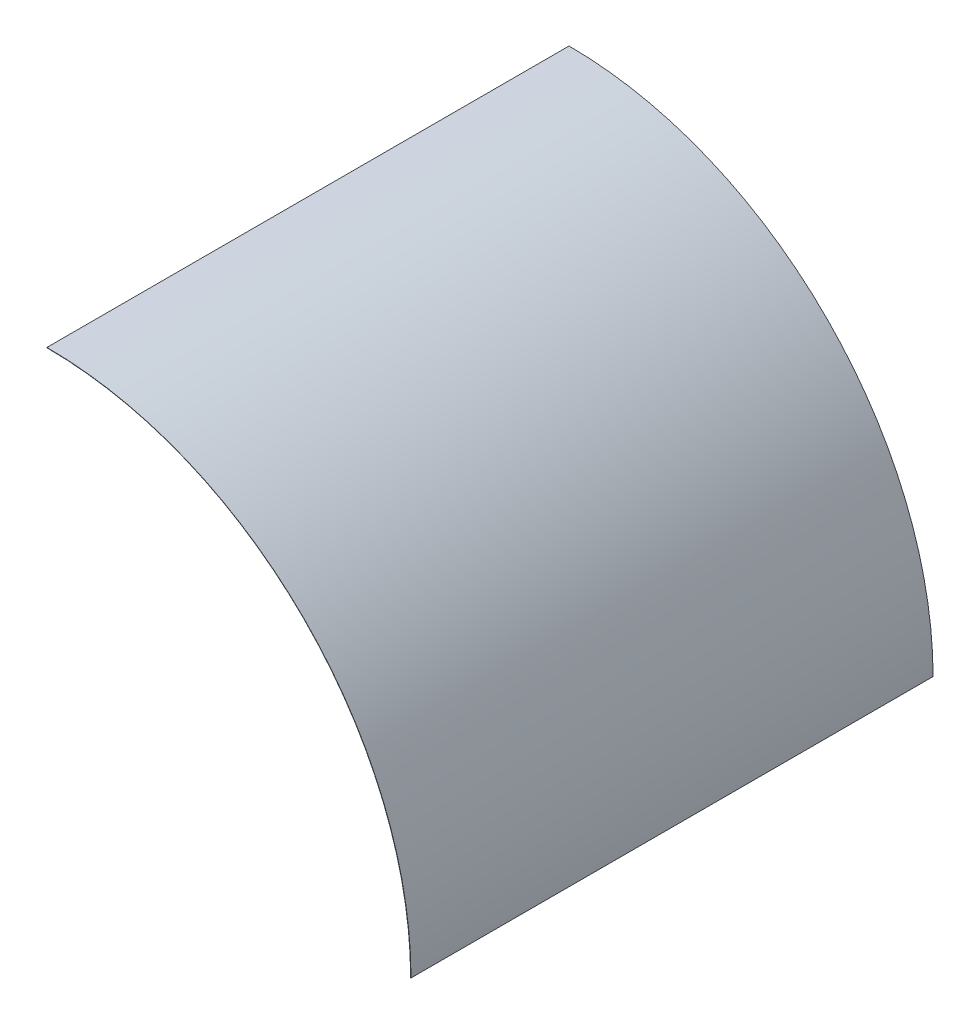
ISO-10303-21;
HEADER;
FILE_DESCRIPTION(('STEP AP214'),'2;1');
FILE_NAME('part.step','',(''),(''),'','','');
FILE_SCHEMA(('AUTOMOTIVE_DESIGN { 1 0 10303 214 1 1 1 1 }'));
ENDSEC;
DATA;
#1=APPLICATION_CONTEXT('core data for automotive mechanical design processes');
#2=APPLICATION_PROTOCOL_DEFINITION('international standard','automotive_design',2000,#1);
#3=PRODUCT_CONTEXT('',#1,'mechanical');
#4=PRODUCT('Part','Part','',(#3));
#5=PRODUCT_RELATED_PRODUCT_CATEGORY('part','',(#4));
#6=PRODUCT_DEFINITION_FORMATION('','',#4);
#7=PRODUCT_DEFINITION_CONTEXT('part definition',#1,'design');
#8=PRODUCT_DEFINITION('design','',#6,#7);
#9=PRODUCT_DEFINITION_SHAPE('','',#8);
#10=(LENGTH_UNIT() NAMED_UNIT(*) SI_UNIT(.MILLI.,.METRE.));
#11=(NAMED_UNIT(*) PLANE_ANGLE_UNIT() SI_UNIT($,.RADIAN.));
#12=(NAMED_UNIT(*) SI_UNIT($,.STERADIAN.) SOLID_ANGLE_UNIT());
#13=UNCERTAINTY_MEASURE_WITH_UNIT(LENGTH_MEASURE(1.E-05),#10,'distance_accuracy_value','');
#14=(GEOMETRIC_REPRESENTATION_CONTEXT(3) GLOBAL_UNCERTAINTY_ASSIGNED_CONTEXT((#13)) GLOBAL_UNIT_ASSIGNED_CONTEXT((#10,
#11,#12)) REPRESENTATION_CONTEXT('',''));
#15=CARTESIAN_POINT('',(0.,0.,0.));
#16=DIRECTION('',(0.,0.,1.));
#17=DIRECTION('',(1.,0.,0.));
#18=AXIS2_PLACEMENT_3D('',#15,#16,#17);
#19=CARTESIAN_POINT('',(0.,0.,-3000.));
#20=DIRECTION('',(0.,0.,1.));
#21=DIRECTION('',(1.,0.,0.));
#22=AXIS2_PLACEMENT_3D('',#19,#20,#21);
#23=CYLINDRICAL_SURFACE('',#22,2090.);
#24=CARTESIAN_POINT('',(0.,0.,0.));
#25=DIRECTION('',(0.,0.,-1.));
#26=DIRECTION('',(-1.,0.,0.));
#27=AXIS2_PLACEMENT_3D('',#24,#25,#26);
#28=CIRCLE('',#27,2090.);
#29=CARTESIAN_POINT('',(0.,2090.,0.));
#30=VERTEX_POINT('',#29);
#31=CARTESIAN_POINT('',(2090.,0.,0.));
#32=VERTEX_POINT('',#31);
#33=EDGE_CURVE('E101',#30,#32,#28,.T.);
#34=ORIENTED_EDGE('',*,*,#33,.F.);
#35=DIRECTION('',(0.,0.,1.));
#36=VECTOR('',#35,1.);
#37=CARTESIAN_POINT('',(0.,2090.,-3000.));
#38=LINE('',#37,#36);
#39=CARTESIAN_POINT('',(0.,2090.,-3000.));
#40=VERTEX_POINT('',#39);
#41=EDGE_CURVE('E11',#40,#30,#38,.T.);
#42=ORIENTED_EDGE('',*,*,#41,.F.);
#43=CARTESIAN_POINT('',(0.,0.,-3000.));
#44=DIRECTION('',(0.,0.,-1.));
#45=DIRECTION('',(-1.,0.,0.));
#46=AXIS2_PLACEMENT_3D('',#43,#44,#45);
#47=CIRCLE('',#46,2090.);
#48=CARTESIAN_POINT('',(2090.,0.,-3000.));
#49=VERTEX_POINT('',#48);
#50=EDGE_CURVE('E95',#40,#49,#47,.T.);
#51=ORIENTED_EDGE('',*,*,#50,.T.);
#52=DIRECTION('',(0.,0.,1.));
#53=VECTOR('',#52,1.);
#54=CARTESIAN_POINT('',(2090.,0.,-3000.));
#55=LINE('',#54,#53);
#56=EDGE_CURVE('E40',#49,#32,#55,.T.);
#57=ORIENTED_EDGE('',*,*,#56,.T.);
#58=EDGE_LOOP('',(#34,#42,#51,#57));
#59=FACE_BOUND('',#58,.T.);
#60=ADVANCED_FACE('F37',(#59),#23,.F.);
#61=CARTESIAN_POINT('',(0.,2092.,-3000.));
#62=DIRECTION('',(-1.,0.,0.));
#63=DIRECTION('',(0.,0.,1.));
#64=AXIS2_PLACEMENT_3D('',#61,#62,#63);
#65=PLANE('',#64);
#66=DIRECTION('',(0.,-1.,0.));
#67=VECTOR('',#66,1.);
#68=CARTESIAN_POINT('',(0.,2092.,0.));
#69=LINE('',#68,#67);
#70=CARTESIAN_POINT('',(0.,2092.,0.));
#71=VERTEX_POINT('',#70);
#72=EDGE_CURVE('E97',#71,#30,#69,.T.);
#73=ORIENTED_EDGE('',*,*,#72,.F.);
#74=DIRECTION('',(0.,0.,1.));
#75=VECTOR('',#74,1.);
#76=CARTESIAN_POINT('',(0.,2092.,-3000.));
#77=LINE('',#76,#75);
#78=CARTESIAN_POINT('',(0.,2092.,-3000.));
#79=VERTEX_POINT('',#78);
#80=EDGE_CURVE('E46',#79,#71,#77,.T.);
#81=ORIENTED_EDGE('',*,*,#80,.F.);
#82=DIRECTION('',(0.,-1.,0.));
#83=VECTOR('',#82,1.);
#84=CARTESIAN_POINT('',(0.,2092.,-3000.));
#85=LINE('',#84,#83);
#86=EDGE_CURVE('E92',#79,#40,#85,.T.);
#87=ORIENTED_EDGE('',*,*,#86,.T.);
#88=ORIENTED_EDGE('',*,*,#41,.T.);
#89=EDGE_LOOP('',(#73,#81,#87,#88));
#90=FACE_BOUND('',#89,.T.);
#91=ADVANCED_FACE('F111',(#90),#65,.T.);
#92=CARTESIAN_POINT('',(0.,0.,-3000.));
#93=DIRECTION('',(0.,0.,1.));
#94=DIRECTION('',(1.,0.,0.));
#95=AXIS2_PLACEMENT_3D('',#92,#93,#94);
#96=CYLINDRICAL_SURFACE('',#95,2092.);
#97=CARTESIAN_POINT('',(0.,0.,0.));
#98=DIRECTION('',(0.,0.,1.));
#99=DIRECTION('',(-1.,0.,0.));
#100=AXIS2_PLACEMENT_3D('',#97,#98,#99);
#101=CIRCLE('',#100,2092.);
#102=CARTESIAN_POINT('',(2092.,2.56196110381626E-13,0.));
#103=VERTEX_POINT('',#102);
#104=EDGE_CURVE('E87',#103,#71,#101,.T.);
#105=ORIENTED_EDGE('',*,*,#104,.F.);
#106=DIRECTION('',(0.,0.,1.));
#107=VECTOR('',#106,1.);
#108=CARTESIAN_POINT('',(2092.,2.56196110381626E-13,-3000.));
#109=LINE('',#108,#107);
#110=CARTESIAN_POINT('',(2092.,2.56196110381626E-13,-3000.));
#111=VERTEX_POINT('',#110);
#112=EDGE_CURVE('E82',#111,#103,#109,.T.);
#113=ORIENTED_EDGE('',*,*,#112,.F.);
#114=CARTESIAN_POINT('',(0.,0.,-3000.));
#115=DIRECTION('',(0.,0.,1.));
#116=DIRECTION('',(-1.,0.,0.));
#117=AXIS2_PLACEMENT_3D('',#114,#115,#116);
#118=CIRCLE('',#117,2092.);
#119=EDGE_CURVE('E85',#111,#79,#118,.T.);
#120=ORIENTED_EDGE('',*,*,#119,.T.);
#121=ORIENTED_EDGE('',*,*,#80,.T.);
#122=EDGE_LOOP('',(#105,#113,#120,#121));
#123=FACE_BOUND('',#122,.T.);
#124=ADVANCED_FACE('F84',(#123),#96,.T.);
#125=CARTESIAN_POINT('',(2092.,0.,-3000.));
#126=DIRECTION('',(0.,-1.,0.));
#127=DIRECTION('',(0.,0.,-1.));
#128=AXIS2_PLACEMENT_3D('',#125,#126,#127);
#129=PLANE('',#128);
#130=DIRECTION('',(1.,0.,0.));
#131=VECTOR('',#130,1.);
#132=CARTESIAN_POINT('',(2092.,0.,0.));
#133=LINE('',#132,#131);
#134=EDGE_CURVE('E104',#32,#103,#133,.T.);
#135=ORIENTED_EDGE('',*,*,#134,.F.);
#136=ORIENTED_EDGE('',*,*,#56,.F.);
#137=DIRECTION('',(1.,0.,0.));
#138=VECTOR('',#137,1.);
#139=CARTESIAN_POINT('',(2092.,0.,-3000.));
#140=LINE('',#139,#138);
#141=EDGE_CURVE('E91',#49,#111,#140,.T.);
#142=ORIENTED_EDGE('',*,*,#141,.T.);
#143=ORIENTED_EDGE('',*,*,#112,.T.);
#144=EDGE_LOOP('',(#135,#136,#142,#143));
#145=FACE_BOUND('',#144,.T.);
#146=ADVANCED_FACE('F94',(#145),#129,.T.);
#147=CARTESIAN_POINT('',(0.,0.,-3000.));
#148=DIRECTION('',(0.,0.,-1.));
#149=DIRECTION('',(-1.,0.,0.));
#150=AXIS2_PLACEMENT_3D('',#147,#148,#149);
#151=PLANE('',#150);
#152=ORIENTED_EDGE('',*,*,#50,.F.);
#153=ORIENTED_EDGE('',*,*,#86,.F.);
#154=ORIENTED_EDGE('',*,*,#119,.F.);
#155=ORIENTED_EDGE('',*,*,#141,.F.);
#156=EDGE_LOOP('',(#152,#153,#154,#155));
#157=FACE_BOUND('',#156,.T.);
#158=ADVANCED_FACE('F90',(#157),#151,.T.);
#159=CARTESIAN_POINT('',(0.,0.,0.));
#160=DIRECTION('',(0.,0.,-1.));
#161=DIRECTION('',(-1.,0.,0.));
#162=AXIS2_PLACEMENT_3D('',#159,#160,#161);
#163=PLANE('',#162);
#164=ORIENTED_EDGE('',*,*,#33,.T.);
#165=ORIENTED_EDGE('',*,*,#134,.T.);
#166=ORIENTED_EDGE('',*,*,#104,.T.);
#167=ORIENTED_EDGE('',*,*,#72,.T.);
#168=EDGE_LOOP('',(#164,#165,#166,#167));
#169=FACE_BOUND('',#168,.T.);
#170=ADVANCED_FACE('F110',(#169),#163,.F.);
#171=CLOSED_SHELL('',(#60,#91,#124,#146,#158,#170));
#172=MANIFOLD_SOLID_BREP('B2',#171);
#173=ADVANCED_BREP_SHAPE_REPRESENTATION('',(#18,#172),#14);
#174=SHAPE_DEFINITION_REPRESENTATION(#9,#173);
ENDSEC;
END-ISO-10303-21;
